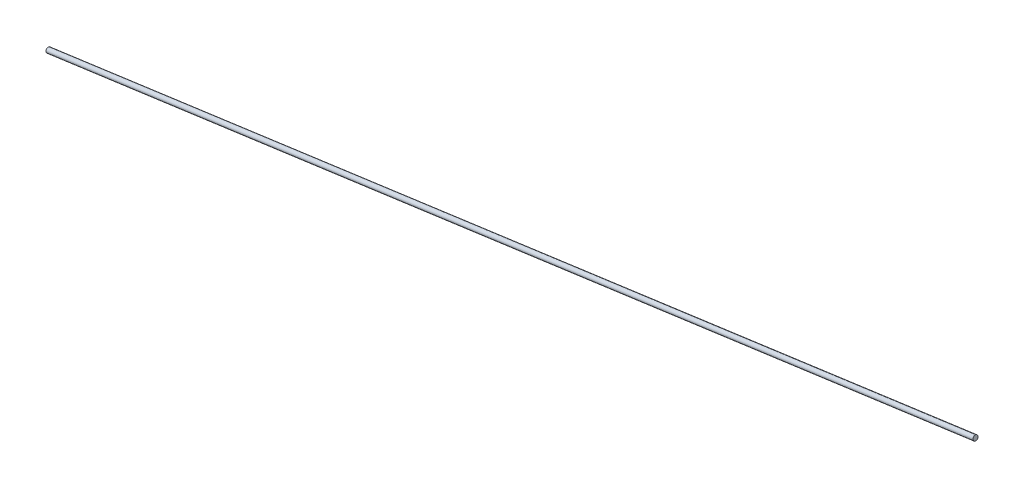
ISO-10303-21;
HEADER;
FILE_DESCRIPTION(('STEP AP214'),'2;1');
FILE_NAME('part.step','',(''),(''),'','','');
FILE_SCHEMA(('AUTOMOTIVE_DESIGN { 1 0 10303 214 1 1 1 1 }'));
ENDSEC;
DATA;
#1=APPLICATION_CONTEXT('core data for automotive mechanical design processes');
#2=APPLICATION_PROTOCOL_DEFINITION('international standard','automotive_design',2000,#1);
#3=PRODUCT_CONTEXT('',#1,'mechanical');
#4=PRODUCT('Part','Part','',(#3));
#5=PRODUCT_RELATED_PRODUCT_CATEGORY('part','',(#4));
#6=PRODUCT_DEFINITION_FORMATION('','',#4);
#7=PRODUCT_DEFINITION_CONTEXT('part definition',#1,'design');
#8=PRODUCT_DEFINITION('design','',#6,#7);
#9=PRODUCT_DEFINITION_SHAPE('','',#8);
#10=(LENGTH_UNIT() NAMED_UNIT(*) SI_UNIT(.MILLI.,.METRE.));
#11=(NAMED_UNIT(*) PLANE_ANGLE_UNIT() SI_UNIT($,.RADIAN.));
#12=(NAMED_UNIT(*) SI_UNIT($,.STERADIAN.) SOLID_ANGLE_UNIT());
#13=UNCERTAINTY_MEASURE_WITH_UNIT(LENGTH_MEASURE(1.E-05),#10,'distance_accuracy_value','');
#14=(GEOMETRIC_REPRESENTATION_CONTEXT(3) GLOBAL_UNCERTAINTY_ASSIGNED_CONTEXT((#13)) GLOBAL_UNIT_ASSIGNED_CONTEXT((#10,
#11,#12)) REPRESENTATION_CONTEXT('',''));
#15=CARTESIAN_POINT('',(0.,0.,0.));
#16=DIRECTION('',(0.,0.,1.));
#17=DIRECTION('',(1.,0.,0.));
#18=AXIS2_PLACEMENT_3D('',#15,#16,#17);
#19=CARTESIAN_POINT('',(163.1606474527,21.11552805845,-13.06579615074));
#20=DIRECTION('',(0.990658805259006,0.136363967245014,0.));
#21=DIRECTION('',(0.,0.,-1.));
#22=AXIS2_PLACEMENT_3D('',#19,#20,#21);
#23=PLANE('',#22);
#24=CARTESIAN_POINT('',(163.100074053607,21.555582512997,-13.5100000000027));
#25=DIRECTION('',(0.990658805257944,0.136363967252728,0.));
#26=DIRECTION('',(-0.136363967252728,0.990658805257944,0.));
#27=AXIS2_PLACEMENT_3D('',#24,#25,#26);
#28=CIRCLE('',#27,0.304999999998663);
#29=CARTESIAN_POINT('',(163.058483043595,21.8577334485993,-13.5100000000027));
#30=VERTEX_POINT('',#29);
#31=EDGE_CURVE('E18',#30,#30,#28,.T.);
#32=ORIENTED_EDGE('',*,*,#31,.T.);
#33=EDGE_LOOP('',(#32));
#34=FACE_BOUND('',#33,.T.);
#35=ADVANCED_FACE('F14',(#34),#23,.T.);
#36=CARTESIAN_POINT('',(48.18365264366,5.737362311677,-13.51));
#37=DIRECTION('',(0.990658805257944,0.136363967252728,0.));
#38=DIRECTION('',(-0.136363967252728,0.990658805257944,0.));
#39=AXIS2_PLACEMENT_3D('',#36,#37,#38);
#40=CYLINDRICAL_SURFACE('',#39,0.304999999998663);
#41=ORIENTED_EDGE('',*,*,#31,.F.);
#42=EDGE_LOOP('',(#41));
#43=FACE_BOUND('',#42,.T.);
#44=CARTESIAN_POINT('',(48.18365264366,5.737362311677,-13.51));
#45=DIRECTION('',(0.990658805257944,0.136363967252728,0.));
#46=DIRECTION('',(-0.136363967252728,0.990658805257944,0.));
#47=AXIS2_PLACEMENT_3D('',#44,#45,#46);
#48=CIRCLE('',#47,0.304999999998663);
#49=CARTESIAN_POINT('',(48.1420616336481,6.03951324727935,-13.51));
#50=VERTEX_POINT('',#49);
#51=EDGE_CURVE('E10',#50,#50,#48,.T.);
#52=ORIENTED_EDGE('',*,*,#51,.T.);
#53=EDGE_LOOP('',(#52));
#54=FACE_BOUND('',#53,.T.);
#55=ADVANCED_FACE('F28',(#43,#54),#40,.T.);
#56=CARTESIAN_POINT('',(48.24422604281,5.297307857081,-13.06579615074));
#57=DIRECTION('',(0.990658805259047,0.136363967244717,0.));
#58=DIRECTION('',(0.,0.,-1.));
#59=AXIS2_PLACEMENT_3D('',#56,#57,#58);
#60=PLANE('',#59);
#61=ORIENTED_EDGE('',*,*,#51,.F.);
#62=EDGE_LOOP('',(#61));
#63=FACE_BOUND('',#62,.T.);
#64=ADVANCED_FACE('F16',(#63),#60,.F.);
#65=CLOSED_SHELL('',(#35,#55,#64));
#66=MANIFOLD_SOLID_BREP('B1',#65);
#67=ADVANCED_BREP_SHAPE_REPRESENTATION('',(#18,#66),#14);
#68=SHAPE_DEFINITION_REPRESENTATION(#9,#67);
ENDSEC;
END-ISO-10303-21;
